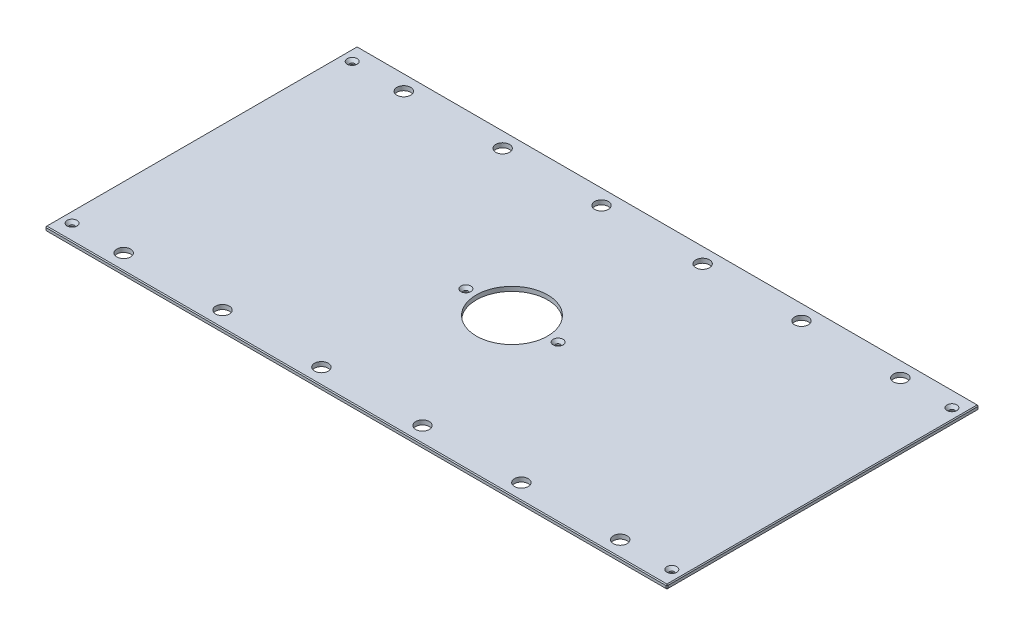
ISO-10303-21;
HEADER;
FILE_DESCRIPTION(('STEP AP214'),'2;1');
FILE_NAME('part.step','',(''),(''),'','','');
FILE_SCHEMA(('AUTOMOTIVE_DESIGN { 1 0 10303 214 1 1 1 1 }'));
ENDSEC;
DATA;
#1=APPLICATION_CONTEXT('core data for automotive mechanical design processes');
#2=APPLICATION_PROTOCOL_DEFINITION('international standard','automotive_design',2000,#1);
#3=PRODUCT_CONTEXT('',#1,'mechanical');
#4=PRODUCT('Part','Part','',(#3));
#5=PRODUCT_RELATED_PRODUCT_CATEGORY('part','',(#4));
#6=PRODUCT_DEFINITION_FORMATION('','',#4);
#7=PRODUCT_DEFINITION_CONTEXT('part definition',#1,'design');
#8=PRODUCT_DEFINITION('design','',#6,#7);
#9=PRODUCT_DEFINITION_SHAPE('','',#8);
#10=(LENGTH_UNIT() NAMED_UNIT(*) SI_UNIT(.MILLI.,.METRE.));
#11=(NAMED_UNIT(*) PLANE_ANGLE_UNIT() SI_UNIT($,.RADIAN.));
#12=(NAMED_UNIT(*) SI_UNIT($,.STERADIAN.) SOLID_ANGLE_UNIT());
#13=UNCERTAINTY_MEASURE_WITH_UNIT(LENGTH_MEASURE(1.E-05),#10,'distance_accuracy_value','');
#14=(GEOMETRIC_REPRESENTATION_CONTEXT(3) GLOBAL_UNCERTAINTY_ASSIGNED_CONTEXT((#13)) GLOBAL_UNIT_ASSIGNED_CONTEXT((#10,
#11,#12)) REPRESENTATION_CONTEXT('',''));
#15=CARTESIAN_POINT('',(0.,0.,0.));
#16=DIRECTION('',(0.,0.,1.));
#17=DIRECTION('',(1.,0.,0.));
#18=AXIS2_PLACEMENT_3D('',#15,#16,#17);
#19=CARTESIAN_POINT('',(-449.2625,6.35,-225.425));
#20=DIRECTION('',(1.,0.,0.));
#21=DIRECTION('',(0.,0.,-1.));
#22=AXIS2_PLACEMENT_3D('',#19,#20,#21);
#23=PLANE('',#22);
#24=DIRECTION('',(0.,0.,-1.));
#25=VECTOR('',#24,1.);
#26=CARTESIAN_POINT('',(-449.2625,5.08000000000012,-225.425));
#27=LINE('',#26,#25);
#28=CARTESIAN_POINT('',(-449.2625,5.08000000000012,224.155));
#29=VERTEX_POINT('',#28);
#30=CARTESIAN_POINT('',(-449.2625,5.08000000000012,-224.155));
#31=VERTEX_POINT('',#30);
#32=EDGE_CURVE('E140',#29,#31,#27,.T.);
#33=ORIENTED_EDGE('',*,*,#32,.T.);
#34=DIRECTION('',(0.,-1.,0.));
#35=VECTOR('',#34,1.);
#36=CARTESIAN_POINT('',(-449.2625,6.35,-224.155));
#37=LINE('',#36,#35);
#38=CARTESIAN_POINT('',(-449.2625,1.26999999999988,-224.155));
#39=VERTEX_POINT('',#38);
#40=EDGE_CURVE('E135',#31,#39,#37,.T.);
#41=ORIENTED_EDGE('',*,*,#40,.T.);
#42=DIRECTION('',(0.,0.,1.));
#43=VECTOR('',#42,1.);
#44=CARTESIAN_POINT('',(-449.2625,1.26999999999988,-225.425));
#45=LINE('',#44,#43);
#46=CARTESIAN_POINT('',(-449.2625,1.26999999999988,224.155));
#47=VERTEX_POINT('',#46);
#48=EDGE_CURVE('E130',#39,#47,#45,.T.);
#49=ORIENTED_EDGE('',*,*,#48,.T.);
#50=DIRECTION('',(0.,1.,0.));
#51=VECTOR('',#50,1.);
#52=CARTESIAN_POINT('',(-449.2625,6.35,224.155));
#53=LINE('',#52,#51);
#54=EDGE_CURVE('E132',#47,#29,#53,.T.);
#55=ORIENTED_EDGE('',*,*,#54,.T.);
#56=EDGE_LOOP('',(#33,#41,#49,#55));
#57=FACE_BOUND('',#56,.T.);
#58=ADVANCED_FACE('F38',(#57),#23,.F.);
#59=CARTESIAN_POINT('',(-449.2625,6.35,225.425));
#60=DIRECTION('',(0.,0.,-1.));
#61=DIRECTION('',(-1.,0.,0.));
#62=AXIS2_PLACEMENT_3D('',#59,#60,#61);
#63=PLANE('',#62);
#64=DIRECTION('',(1.,0.,0.));
#65=VECTOR('',#64,1.);
#66=CARTESIAN_POINT('',(-449.2625,1.26999999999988,225.425));
#67=LINE('',#66,#65);
#68=CARTESIAN_POINT('',(-447.9925,1.26999999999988,225.425));
#69=VERTEX_POINT('',#68);
#70=CARTESIAN_POINT('',(447.9925,1.26999999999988,225.425));
#71=VERTEX_POINT('',#70);
#72=EDGE_CURVE('E62',#69,#71,#67,.T.);
#73=ORIENTED_EDGE('',*,*,#72,.T.);
#74=DIRECTION('',(0.,1.,0.));
#75=VECTOR('',#74,1.);
#76=CARTESIAN_POINT('',(447.9925,6.35,225.425));
#77=LINE('',#76,#75);
#78=CARTESIAN_POINT('',(447.9925,5.08000000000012,225.425));
#79=VERTEX_POINT('',#78);
#80=EDGE_CURVE('E11',#71,#79,#77,.T.);
#81=ORIENTED_EDGE('',*,*,#80,.T.);
#82=DIRECTION('',(-1.,0.,0.));
#83=VECTOR('',#82,1.);
#84=CARTESIAN_POINT('',(-449.2625,5.08000000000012,225.425));
#85=LINE('',#84,#83);
#86=CARTESIAN_POINT('',(-447.9925,5.08000000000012,225.425));
#87=VERTEX_POINT('',#86);
#88=EDGE_CURVE('E48',#79,#87,#85,.T.);
#89=ORIENTED_EDGE('',*,*,#88,.T.);
#90=DIRECTION('',(0.,-1.,0.));
#91=VECTOR('',#90,1.);
#92=CARTESIAN_POINT('',(-447.9925,6.35,225.425));
#93=LINE('',#92,#91);
#94=EDGE_CURVE('E398',#87,#69,#93,.T.);
#95=ORIENTED_EDGE('',*,*,#94,.T.);
#96=EDGE_LOOP('',(#73,#81,#89,#95));
#97=FACE_BOUND('',#96,.T.);
#98=ADVANCED_FACE('F475',(#97),#63,.F.);
#99=CARTESIAN_POINT('',(449.2625,6.35,-225.425));
#100=DIRECTION('',(-1.,0.,0.));
#101=DIRECTION('',(0.,0.,1.));
#102=AXIS2_PLACEMENT_3D('',#99,#100,#101);
#103=PLANE('',#102);
#104=DIRECTION('',(0.,0.,-1.));
#105=VECTOR('',#104,1.);
#106=CARTESIAN_POINT('',(449.2625,1.26999999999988,-225.425));
#107=LINE('',#106,#105);
#108=CARTESIAN_POINT('',(449.2625,1.26999999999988,224.155));
#109=VERTEX_POINT('',#108);
#110=CARTESIAN_POINT('',(449.2625,1.26999999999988,-224.155));
#111=VERTEX_POINT('',#110);
#112=EDGE_CURVE('E391',#109,#111,#107,.T.);
#113=ORIENTED_EDGE('',*,*,#112,.T.);
#114=DIRECTION('',(0.,1.,0.));
#115=VECTOR('',#114,1.);
#116=CARTESIAN_POINT('',(449.2625,6.35,-224.155));
#117=LINE('',#116,#115);
#118=CARTESIAN_POINT('',(449.2625,5.08000000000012,-224.155));
#119=VERTEX_POINT('',#118);
#120=EDGE_CURVE('E394',#111,#119,#117,.T.);
#121=ORIENTED_EDGE('',*,*,#120,.T.);
#122=DIRECTION('',(0.,0.,1.));
#123=VECTOR('',#122,1.);
#124=CARTESIAN_POINT('',(449.2625,5.08000000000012,225.425));
#125=LINE('',#124,#123);
#126=CARTESIAN_POINT('',(449.2625,5.08000000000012,224.155));
#127=VERTEX_POINT('',#126);
#128=EDGE_CURVE('E388',#119,#127,#125,.T.);
#129=ORIENTED_EDGE('',*,*,#128,.T.);
#130=DIRECTION('',(0.,-1.,0.));
#131=VECTOR('',#130,1.);
#132=CARTESIAN_POINT('',(449.2625,6.35,224.155));
#133=LINE('',#132,#131);
#134=EDGE_CURVE('E385',#127,#109,#133,.T.);
#135=ORIENTED_EDGE('',*,*,#134,.T.);
#136=EDGE_LOOP('',(#113,#121,#129,#135));
#137=FACE_BOUND('',#136,.T.);
#138=ADVANCED_FACE('F462',(#137),#103,.F.);
#139=CARTESIAN_POINT('',(-449.2625,6.35,-225.425));
#140=DIRECTION('',(0.,0.,1.));
#141=DIRECTION('',(1.,0.,0.));
#142=AXIS2_PLACEMENT_3D('',#139,#140,#141);
#143=PLANE('',#142);
#144=DIRECTION('',(-1.,0.,0.));
#145=VECTOR('',#144,1.);
#146=CARTESIAN_POINT('',(-449.2625,1.26999999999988,-225.425));
#147=LINE('',#146,#145);
#148=CARTESIAN_POINT('',(447.9925,1.26999999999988,-225.425));
#149=VERTEX_POINT('',#148);
#150=CARTESIAN_POINT('',(-447.9925,1.26999999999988,-225.425));
#151=VERTEX_POINT('',#150);
#152=EDGE_CURVE('E350',#149,#151,#147,.T.);
#153=ORIENTED_EDGE('',*,*,#152,.T.);
#154=DIRECTION('',(0.,1.,0.));
#155=VECTOR('',#154,1.);
#156=CARTESIAN_POINT('',(-447.9925,6.35,-225.425));
#157=LINE('',#156,#155);
#158=CARTESIAN_POINT('',(-447.9925,5.08000000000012,-225.425));
#159=VERTEX_POINT('',#158);
#160=EDGE_CURVE('E356',#151,#159,#157,.T.);
#161=ORIENTED_EDGE('',*,*,#160,.T.);
#162=DIRECTION('',(1.,0.,0.));
#163=VECTOR('',#162,1.);
#164=CARTESIAN_POINT('',(449.2625,5.08000000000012,-225.425));
#165=LINE('',#164,#163);
#166=CARTESIAN_POINT('',(447.9925,5.08000000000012,-225.425));
#167=VERTEX_POINT('',#166);
#168=EDGE_CURVE('E353',#159,#167,#165,.T.);
#169=ORIENTED_EDGE('',*,*,#168,.T.);
#170=DIRECTION('',(0.,-1.,0.));
#171=VECTOR('',#170,1.);
#172=CARTESIAN_POINT('',(447.9925,6.35,-225.425));
#173=LINE('',#172,#171);
#174=EDGE_CURVE('E347',#167,#149,#173,.T.);
#175=ORIENTED_EDGE('',*,*,#174,.T.);
#176=EDGE_LOOP('',(#153,#161,#169,#175));
#177=FACE_BOUND('',#176,.T.);
#178=ADVANCED_FACE('F436',(#177),#143,.F.);
#179=CARTESIAN_POINT('',(0.,6.35,0.));
#180=DIRECTION('',(0.,1.,0.));
#181=DIRECTION('',(0.,0.,1.));
#182=AXIS2_PLACEMENT_3D('',#179,#180,#181);
#183=PLANE('',#182);
#184=CARTESIAN_POINT('',(433.3875,6.35,-202.40498));
#185=DIRECTION('',(0.,1.,0.));
#186=DIRECTION('',(0.,0.,1.));
#187=AXIS2_PLACEMENT_3D('',#184,#185,#186);
#188=CIRCLE('',#187,7.13740000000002);
#189=CARTESIAN_POINT('',(433.3875,6.35,-195.26758));
#190=VERTEX_POINT('',#189);
#191=EDGE_CURVE('E1071',#190,#190,#188,.T.);
#192=ORIENTED_EDGE('',*,*,#191,.F.);
#193=EDGE_LOOP('',(#192));
#194=FACE_BOUND('',#193,.T.);
#195=CARTESIAN_POINT('',(433.3875,6.35,202.40498));
#196=DIRECTION('',(0.,1.,0.));
#197=DIRECTION('',(0.,0.,1.));
#198=AXIS2_PLACEMENT_3D('',#195,#196,#197);
#199=CIRCLE('',#198,7.13740000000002);
#200=CARTESIAN_POINT('',(433.3875,6.35,209.54238));
#201=VERTEX_POINT('',#200);
#202=EDGE_CURVE('E1075',#201,#201,#199,.T.);
#203=ORIENTED_EDGE('',*,*,#202,.F.);
#204=EDGE_LOOP('',(#203));
#205=FACE_BOUND('',#204,.T.);
#206=CARTESIAN_POINT('',(-433.3875,6.35,202.40498));
#207=DIRECTION('',(0.,1.,0.));
#208=DIRECTION('',(0.,0.,1.));
#209=AXIS2_PLACEMENT_3D('',#206,#207,#208);
#210=CIRCLE('',#209,7.13740000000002);
#211=CARTESIAN_POINT('',(-433.3875,6.35,209.54238));
#212=VERTEX_POINT('',#211);
#213=EDGE_CURVE('E1079',#212,#212,#210,.T.);
#214=ORIENTED_EDGE('',*,*,#213,.F.);
#215=EDGE_LOOP('',(#214));
#216=FACE_BOUND('',#215,.T.);
#217=CARTESIAN_POINT('',(-66.675,6.35,0.));
#218=DIRECTION('',(0.,1.,0.));
#219=DIRECTION('',(0.,0.,1.));
#220=AXIS2_PLACEMENT_3D('',#217,#218,#219);
#221=CIRCLE('',#220,7.1374);
#222=CARTESIAN_POINT('',(-66.675,6.35,7.1374));
#223=VERTEX_POINT('',#222);
#224=EDGE_CURVE('E1083',#223,#223,#221,.T.);
#225=ORIENTED_EDGE('',*,*,#224,.F.);
#226=EDGE_LOOP('',(#225));
#227=FACE_BOUND('',#226,.T.);
#228=CARTESIAN_POINT('',(66.675,6.35,0.));
#229=DIRECTION('',(0.,1.,0.));
#230=DIRECTION('',(0.,0.,1.));
#231=AXIS2_PLACEMENT_3D('',#228,#229,#230);
#232=CIRCLE('',#231,7.1374);
#233=CARTESIAN_POINT('',(66.675,6.35,7.1374));
#234=VERTEX_POINT('',#233);
#235=EDGE_CURVE('E1087',#234,#234,#232,.T.);
#236=ORIENTED_EDGE('',*,*,#235,.F.);
#237=EDGE_LOOP('',(#236));
#238=FACE_BOUND('',#237,.T.);
#239=CARTESIAN_POINT('',(-433.3875,6.35,-202.40498));
#240=DIRECTION('',(0.,1.,0.));
#241=DIRECTION('',(0.,0.,1.));
#242=AXIS2_PLACEMENT_3D('',#239,#240,#241);
#243=CIRCLE('',#242,7.13740000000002);
#244=CARTESIAN_POINT('',(-433.3875,6.35,-195.26758));
#245=VERTEX_POINT('',#244);
#246=EDGE_CURVE('E1090',#245,#245,#243,.T.);
#247=ORIENTED_EDGE('',*,*,#246,.F.);
#248=EDGE_LOOP('',(#247));
#249=FACE_BOUND('',#248,.T.);
#250=DIRECTION('',(0.,0.,-1.));
#251=VECTOR('',#250,1.);
#252=CARTESIAN_POINT('',(447.9925,6.35,-225.425));
#253=LINE('',#252,#251);
#254=CARTESIAN_POINT('',(447.9925,6.35,224.155));
#255=VERTEX_POINT('',#254);
#256=CARTESIAN_POINT('',(447.9925,6.35,-224.155));
#257=VERTEX_POINT('',#256);
#258=EDGE_CURVE('E366',#255,#257,#253,.T.);
#259=ORIENTED_EDGE('',*,*,#258,.T.);
#260=DIRECTION('',(-1.,0.,0.));
#261=VECTOR('',#260,1.);
#262=CARTESIAN_POINT('',(-449.2625,6.35,-224.155));
#263=LINE('',#262,#261);
#264=CARTESIAN_POINT('',(-447.9925,6.35,-224.155));
#265=VERTEX_POINT('',#264);
#266=EDGE_CURVE('E369',#257,#265,#263,.T.);
#267=ORIENTED_EDGE('',*,*,#266,.T.);
#268=DIRECTION('',(0.,0.,1.));
#269=VECTOR('',#268,1.);
#270=CARTESIAN_POINT('',(-447.9925,6.35,225.425));
#271=LINE('',#270,#269);
#272=CARTESIAN_POINT('',(-447.9925,6.35,224.155));
#273=VERTEX_POINT('',#272);
#274=EDGE_CURVE('E363',#265,#273,#271,.T.);
#275=ORIENTED_EDGE('',*,*,#274,.T.);
#276=DIRECTION('',(1.,0.,0.));
#277=VECTOR('',#276,1.);
#278=CARTESIAN_POINT('',(449.2625,6.35,224.155));
#279=LINE('',#278,#277);
#280=EDGE_CURVE('E360',#273,#255,#279,.T.);
#281=ORIENTED_EDGE('',*,*,#280,.T.);
#282=EDGE_LOOP('',(#259,#267,#275,#281));
#283=FACE_BOUND('',#282,.T.);
#284=CARTESIAN_POINT('',(358.775,6.35,-202.40498));
#285=DIRECTION('',(0.,1.,0.));
#286=DIRECTION('',(0.,0.,1.));
#287=AXIS2_PLACEMENT_3D('',#284,#285,#286);
#288=CIRCLE('',#287,9.92187500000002);
#289=CARTESIAN_POINT('',(358.775,6.35,-192.483105));
#290=VERTEX_POINT('',#289);
#291=EDGE_CURVE('E231',#290,#290,#288,.T.);
#292=ORIENTED_EDGE('',*,*,#291,.F.);
#293=EDGE_LOOP('',(#292));
#294=FACE_BOUND('',#293,.T.);
#295=CARTESIAN_POINT('',(-358.775,6.35,-202.40498));
#296=DIRECTION('',(0.,1.,0.));
#297=DIRECTION('',(0.,0.,1.));
#298=AXIS2_PLACEMENT_3D('',#295,#296,#297);
#299=CIRCLE('',#298,9.92187500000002);
#300=CARTESIAN_POINT('',(-358.775,6.35,-192.483105));
#301=VERTEX_POINT('',#300);
#302=EDGE_CURVE('E246',#301,#301,#299,.T.);
#303=ORIENTED_EDGE('',*,*,#302,.F.);
#304=EDGE_LOOP('',(#303));
#305=FACE_BOUND('',#304,.T.);
#306=CARTESIAN_POINT('',(358.775,6.35,202.40498));
#307=DIRECTION('',(0.,1.,0.));
#308=DIRECTION('',(0.,0.,1.));
#309=AXIS2_PLACEMENT_3D('',#306,#307,#308);
#310=CIRCLE('',#309,9.92187500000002);
#311=CARTESIAN_POINT('',(358.775,6.35,212.326855));
#312=VERTEX_POINT('',#311);
#313=EDGE_CURVE('E259',#312,#312,#310,.T.);
#314=ORIENTED_EDGE('',*,*,#313,.F.);
#315=EDGE_LOOP('',(#314));
#316=FACE_BOUND('',#315,.T.);
#317=CARTESIAN_POINT('',(-358.775,6.35,202.40498));
#318=DIRECTION('',(0.,1.,0.));
#319=DIRECTION('',(0.,0.,1.));
#320=AXIS2_PLACEMENT_3D('',#317,#318,#319);
#321=CIRCLE('',#320,9.92187500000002);
#322=CARTESIAN_POINT('',(-358.775,6.35,212.326855));
#323=VERTEX_POINT('',#322);
#324=EDGE_CURVE('E267',#323,#323,#321,.T.);
#325=ORIENTED_EDGE('',*,*,#324,.F.);
#326=EDGE_LOOP('',(#325));
#327=FACE_BOUND('',#326,.T.);
#328=CARTESIAN_POINT('',(-215.9,6.35,-202.40498));
#329=DIRECTION('',(0.,1.,0.));
#330=DIRECTION('',(0.,0.,1.));
#331=AXIS2_PLACEMENT_3D('',#328,#329,#330);
#332=CIRCLE('',#331,9.921875);
#333=CARTESIAN_POINT('',(-215.9,6.35,-192.483105));
#334=VERTEX_POINT('',#333);
#335=EDGE_CURVE('E275',#334,#334,#332,.T.);
#336=ORIENTED_EDGE('',*,*,#335,.F.);
#337=EDGE_LOOP('',(#336));
#338=FACE_BOUND('',#337,.T.);
#339=CARTESIAN_POINT('',(215.9,6.35,-202.40498));
#340=DIRECTION('',(0.,1.,0.));
#341=DIRECTION('',(0.,0.,1.));
#342=AXIS2_PLACEMENT_3D('',#339,#340,#341);
#343=CIRCLE('',#342,9.921875);
#344=CARTESIAN_POINT('',(215.9,6.35,-192.483105));
#345=VERTEX_POINT('',#344);
#346=EDGE_CURVE('E283',#345,#345,#343,.T.);
#347=ORIENTED_EDGE('',*,*,#346,.F.);
#348=EDGE_LOOP('',(#347));
#349=FACE_BOUND('',#348,.T.);
#350=CARTESIAN_POINT('',(215.9,6.35,202.40498));
#351=DIRECTION('',(0.,1.,0.));
#352=DIRECTION('',(0.,0.,1.));
#353=AXIS2_PLACEMENT_3D('',#350,#351,#352);
#354=CIRCLE('',#353,9.921875);
#355=CARTESIAN_POINT('',(215.9,6.35,212.326855));
#356=VERTEX_POINT('',#355);
#357=EDGE_CURVE('E290',#356,#356,#354,.T.);
#358=ORIENTED_EDGE('',*,*,#357,.F.);
#359=EDGE_LOOP('',(#358));
#360=FACE_BOUND('',#359,.T.);
#361=CARTESIAN_POINT('',(-215.9,6.35,202.40498));
#362=DIRECTION('',(0.,1.,0.));
#363=DIRECTION('',(0.,0.,1.));
#364=AXIS2_PLACEMENT_3D('',#361,#362,#363);
#365=CIRCLE('',#364,9.921875);
#366=CARTESIAN_POINT('',(-215.9,6.35,212.326855));
#367=VERTEX_POINT('',#366);
#368=EDGE_CURVE('E297',#367,#367,#365,.T.);
#369=ORIENTED_EDGE('',*,*,#368,.F.);
#370=EDGE_LOOP('',(#369));
#371=FACE_BOUND('',#370,.T.);
#372=CARTESIAN_POINT('',(73.025,6.35,-202.40498));
#373=DIRECTION('',(0.,1.,0.));
#374=DIRECTION('',(0.,0.,1.));
#375=AXIS2_PLACEMENT_3D('',#372,#373,#374);
#376=CIRCLE('',#375,9.921875);
#377=CARTESIAN_POINT('',(73.025,6.35,-192.483105));
#378=VERTEX_POINT('',#377);
#379=EDGE_CURVE('E305',#378,#378,#376,.T.);
#380=ORIENTED_EDGE('',*,*,#379,.F.);
#381=EDGE_LOOP('',(#380));
#382=FACE_BOUND('',#381,.T.);
#383=CARTESIAN_POINT('',(-73.025,6.35,-202.40498));
#384=DIRECTION('',(0.,1.,0.));
#385=DIRECTION('',(0.,0.,1.));
#386=AXIS2_PLACEMENT_3D('',#383,#384,#385);
#387=CIRCLE('',#386,9.921875);
#388=CARTESIAN_POINT('',(-73.025,6.35,-192.483105));
#389=VERTEX_POINT('',#388);
#390=EDGE_CURVE('E313',#389,#389,#387,.T.);
#391=ORIENTED_EDGE('',*,*,#390,.F.);
#392=EDGE_LOOP('',(#391));
#393=FACE_BOUND('',#392,.T.);
#394=CARTESIAN_POINT('',(-73.025,6.35,202.40498));
#395=DIRECTION('',(0.,1.,0.));
#396=DIRECTION('',(0.,0.,1.));
#397=AXIS2_PLACEMENT_3D('',#394,#395,#396);
#398=CIRCLE('',#397,9.921875);
#399=CARTESIAN_POINT('',(-73.025,6.35,212.326855));
#400=VERTEX_POINT('',#399);
#401=EDGE_CURVE('E321',#400,#400,#398,.T.);
#402=ORIENTED_EDGE('',*,*,#401,.F.);
#403=EDGE_LOOP('',(#402));
#404=FACE_BOUND('',#403,.T.);
#405=CARTESIAN_POINT('',(73.025,6.35,202.40498));
#406=DIRECTION('',(0.,1.,0.));
#407=DIRECTION('',(0.,0.,1.));
#408=AXIS2_PLACEMENT_3D('',#405,#406,#407);
#409=CIRCLE('',#408,9.921875);
#410=CARTESIAN_POINT('',(73.025,6.35,212.326855));
#411=VERTEX_POINT('',#410);
#412=EDGE_CURVE('E328',#411,#411,#409,.T.);
#413=ORIENTED_EDGE('',*,*,#412,.F.);
#414=EDGE_LOOP('',(#413));
#415=FACE_BOUND('',#414,.T.);
#416=CARTESIAN_POINT('',(0.,6.35,0.));
#417=DIRECTION('',(0.,1.,0.));
#418=DIRECTION('',(0.,0.,1.));
#419=AXIS2_PLACEMENT_3D('',#416,#417,#418);
#420=CIRCLE('',#419,51.562);
#421=CARTESIAN_POINT('',(0.,6.35,51.562));
#422=VERTEX_POINT('',#421);
#423=EDGE_CURVE('E336',#422,#422,#420,.T.);
#424=ORIENTED_EDGE('',*,*,#423,.F.);
#425=EDGE_LOOP('',(#424));
#426=FACE_BOUND('',#425,.T.);
#427=ADVANCED_FACE('F484',(#194,#205,#216,#227,#238,#249,#283,#294,#305,#316,#327,#338,#349,
#360,#371,#382,#393,#404,#415,#426),#183,.T.);
#428=CARTESIAN_POINT('',(0.,0.,0.));
#429=DIRECTION('',(0.,1.,0.));
#430=DIRECTION('',(0.,0.,1.));
#431=AXIS2_PLACEMENT_3D('',#428,#429,#430);
#432=PLANE('',#431);
#433=CARTESIAN_POINT('',(433.3875,0.,-202.40498));
#434=DIRECTION('',(0.,1.,0.));
#435=DIRECTION('',(0.,0.,1.));
#436=AXIS2_PLACEMENT_3D('',#433,#434,#435);
#437=CIRCLE('',#436,3.3782);
#438=CARTESIAN_POINT('',(433.3875,0.,-199.02678));
#439=VERTEX_POINT('',#438);
#440=EDGE_CURVE('E1136',#439,#439,#437,.T.);
#441=ORIENTED_EDGE('',*,*,#440,.T.);
#442=EDGE_LOOP('',(#441));
#443=FACE_BOUND('',#442,.T.);
#444=CARTESIAN_POINT('',(433.3875,0.,202.40498));
#445=DIRECTION('',(0.,1.,0.));
#446=DIRECTION('',(0.,0.,1.));
#447=AXIS2_PLACEMENT_3D('',#444,#445,#446);
#448=CIRCLE('',#447,3.3782);
#449=CARTESIAN_POINT('',(433.3875,0.,205.78318));
#450=VERTEX_POINT('',#449);
#451=EDGE_CURVE('E1127',#450,#450,#448,.T.);
#452=ORIENTED_EDGE('',*,*,#451,.T.);
#453=EDGE_LOOP('',(#452));
#454=FACE_BOUND('',#453,.T.);
#455=CARTESIAN_POINT('',(-433.3875,0.,202.40498));
#456=DIRECTION('',(0.,1.,0.));
#457=DIRECTION('',(0.,0.,1.));
#458=AXIS2_PLACEMENT_3D('',#455,#456,#457);
#459=CIRCLE('',#458,3.3782);
#460=CARTESIAN_POINT('',(-433.3875,0.,205.78318));
#461=VERTEX_POINT('',#460);
#462=EDGE_CURVE('E1117',#461,#461,#459,.T.);
#463=ORIENTED_EDGE('',*,*,#462,.T.);
#464=EDGE_LOOP('',(#463));
#465=FACE_BOUND('',#464,.T.);
#466=CARTESIAN_POINT('',(-66.675,0.,0.));
#467=DIRECTION('',(0.,1.,0.));
#468=DIRECTION('',(0.,0.,1.));
#469=AXIS2_PLACEMENT_3D('',#466,#467,#468);
#470=CIRCLE('',#469,3.3782);
#471=CARTESIAN_POINT('',(-66.675,0.,3.3782));
#472=VERTEX_POINT('',#471);
#473=EDGE_CURVE('E1107',#472,#472,#470,.T.);
#474=ORIENTED_EDGE('',*,*,#473,.T.);
#475=EDGE_LOOP('',(#474));
#476=FACE_BOUND('',#475,.T.);
#477=CARTESIAN_POINT('',(66.675,0.,0.));
#478=DIRECTION('',(0.,1.,0.));
#479=DIRECTION('',(0.,0.,1.));
#480=AXIS2_PLACEMENT_3D('',#477,#478,#479);
#481=CIRCLE('',#480,3.3782);
#482=CARTESIAN_POINT('',(66.675,0.,3.3782));
#483=VERTEX_POINT('',#482);
#484=EDGE_CURVE('E1093',#483,#483,#481,.T.);
#485=ORIENTED_EDGE('',*,*,#484,.T.);
#486=EDGE_LOOP('',(#485));
#487=FACE_BOUND('',#486,.T.);
#488=CARTESIAN_POINT('',(-433.3875,0.,-202.40498));
#489=DIRECTION('',(0.,1.,0.));
#490=DIRECTION('',(0.,0.,1.));
#491=AXIS2_PLACEMENT_3D('',#488,#489,#490);
#492=CIRCLE('',#491,3.3782);
#493=CARTESIAN_POINT('',(-433.3875,0.,-199.02678));
#494=VERTEX_POINT('',#493);
#495=EDGE_CURVE('E249',#494,#494,#492,.T.);
#496=ORIENTED_EDGE('',*,*,#495,.T.);
#497=EDGE_LOOP('',(#496));
#498=FACE_BOUND('',#497,.T.);
#499=DIRECTION('',(0.,0.,-1.));
#500=VECTOR('',#499,1.);
#501=CARTESIAN_POINT('',(-447.9925,0.,0.));
#502=LINE('',#501,#500);
#503=CARTESIAN_POINT('',(-447.9925,0.,224.155));
#504=VERTEX_POINT('',#503);
#505=CARTESIAN_POINT('',(-447.9925,0.,-224.155));
#506=VERTEX_POINT('',#505);
#507=EDGE_CURVE('E165',#504,#506,#502,.T.);
#508=ORIENTED_EDGE('',*,*,#507,.T.);
#509=DIRECTION('',(1.,0.,0.));
#510=VECTOR('',#509,1.);
#511=CARTESIAN_POINT('',(0.,0.,-224.155));
#512=LINE('',#511,#510);
#513=CARTESIAN_POINT('',(447.9925,0.,-224.155));
#514=VERTEX_POINT('',#513);
#515=EDGE_CURVE('E381',#506,#514,#512,.T.);
#516=ORIENTED_EDGE('',*,*,#515,.T.);
#517=DIRECTION('',(0.,0.,1.));
#518=VECTOR('',#517,1.);
#519=CARTESIAN_POINT('',(447.9925,0.,0.));
#520=LINE('',#519,#518);
#521=CARTESIAN_POINT('',(447.9925,0.,224.155));
#522=VERTEX_POINT('',#521);
#523=EDGE_CURVE('E378',#514,#522,#520,.T.);
#524=ORIENTED_EDGE('',*,*,#523,.T.);
#525=DIRECTION('',(-1.,0.,0.));
#526=VECTOR('',#525,1.);
#527=CARTESIAN_POINT('',(0.,0.,224.155));
#528=LINE('',#527,#526);
#529=EDGE_CURVE('E373',#522,#504,#528,.T.);
#530=ORIENTED_EDGE('',*,*,#529,.T.);
#531=EDGE_LOOP('',(#508,#516,#524,#530));
#532=FACE_BOUND('',#531,.T.);
#533=CARTESIAN_POINT('',(358.775,0.,-202.40498));
#534=DIRECTION('',(0.,1.,0.));
#535=DIRECTION('',(0.,0.,1.));
#536=AXIS2_PLACEMENT_3D('',#533,#534,#535);
#537=CIRCLE('',#536,9.92187499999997);
#538=CARTESIAN_POINT('',(358.775,0.,-192.483105));
#539=VERTEX_POINT('',#538);
#540=EDGE_CURVE('E238',#539,#539,#537,.T.);
#541=ORIENTED_EDGE('',*,*,#540,.T.);
#542=EDGE_LOOP('',(#541));
#543=FACE_BOUND('',#542,.T.);
#544=CARTESIAN_POINT('',(-358.775,0.,-202.40498));
#545=DIRECTION('',(0.,1.,0.));
#546=DIRECTION('',(0.,0.,1.));
#547=AXIS2_PLACEMENT_3D('',#544,#545,#546);
#548=CIRCLE('',#547,9.92187499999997);
#549=CARTESIAN_POINT('',(-358.775,0.,-192.483105));
#550=VERTEX_POINT('',#549);
#551=EDGE_CURVE('E255',#550,#550,#548,.T.);
#552=ORIENTED_EDGE('',*,*,#551,.T.);
#553=EDGE_LOOP('',(#552));
#554=FACE_BOUND('',#553,.T.);
#555=CARTESIAN_POINT('',(358.775,0.,202.40498));
#556=DIRECTION('',(0.,1.,0.));
#557=DIRECTION('',(0.,0.,1.));
#558=AXIS2_PLACEMENT_3D('',#555,#556,#557);
#559=CIRCLE('',#558,9.92187499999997);
#560=CARTESIAN_POINT('',(358.775,0.,212.326855));
#561=VERTEX_POINT('',#560);
#562=EDGE_CURVE('E263',#561,#561,#559,.T.);
#563=ORIENTED_EDGE('',*,*,#562,.T.);
#564=EDGE_LOOP('',(#563));
#565=FACE_BOUND('',#564,.T.);
#566=CARTESIAN_POINT('',(-358.775,0.,202.40498));
#567=DIRECTION('',(0.,1.,0.));
#568=DIRECTION('',(0.,0.,1.));
#569=AXIS2_PLACEMENT_3D('',#566,#567,#568);
#570=CIRCLE('',#569,9.92187499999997);
#571=CARTESIAN_POINT('',(-358.775,0.,212.326855));
#572=VERTEX_POINT('',#571);
#573=EDGE_CURVE('E271',#572,#572,#570,.T.);
#574=ORIENTED_EDGE('',*,*,#573,.T.);
#575=EDGE_LOOP('',(#574));
#576=FACE_BOUND('',#575,.T.);
#577=CARTESIAN_POINT('',(-215.9,0.,-202.40498));
#578=DIRECTION('',(0.,1.,0.));
#579=DIRECTION('',(0.,0.,1.));
#580=AXIS2_PLACEMENT_3D('',#577,#578,#579);
#581=CIRCLE('',#580,9.921875);
#582=CARTESIAN_POINT('',(-215.9,0.,-192.483105));
#583=VERTEX_POINT('',#582);
#584=EDGE_CURVE('E279',#583,#583,#581,.T.);
#585=ORIENTED_EDGE('',*,*,#584,.T.);
#586=EDGE_LOOP('',(#585));
#587=FACE_BOUND('',#586,.T.);
#588=CARTESIAN_POINT('',(215.9,0.,-202.40498));
#589=DIRECTION('',(0.,1.,0.));
#590=DIRECTION('',(0.,0.,1.));
#591=AXIS2_PLACEMENT_3D('',#588,#589,#590);
#592=CIRCLE('',#591,9.921875);
#593=CARTESIAN_POINT('',(215.9,0.,-192.483105));
#594=VERTEX_POINT('',#593);
#595=EDGE_CURVE('E287',#594,#594,#592,.T.);
#596=ORIENTED_EDGE('',*,*,#595,.T.);
#597=EDGE_LOOP('',(#596));
#598=FACE_BOUND('',#597,.T.);
#599=CARTESIAN_POINT('',(215.9,0.,202.40498));
#600=DIRECTION('',(0.,1.,0.));
#601=DIRECTION('',(0.,0.,1.));
#602=AXIS2_PLACEMENT_3D('',#599,#600,#601);
#603=CIRCLE('',#602,9.921875);
#604=CARTESIAN_POINT('',(215.9,0.,212.326855));
#605=VERTEX_POINT('',#604);
#606=EDGE_CURVE('E293',#605,#605,#603,.T.);
#607=ORIENTED_EDGE('',*,*,#606,.T.);
#608=EDGE_LOOP('',(#607));
#609=FACE_BOUND('',#608,.T.);
#610=CARTESIAN_POINT('',(-215.9,0.,202.40498));
#611=DIRECTION('',(0.,1.,0.));
#612=DIRECTION('',(0.,0.,1.));
#613=AXIS2_PLACEMENT_3D('',#610,#611,#612);
#614=CIRCLE('',#613,9.921875);
#615=CARTESIAN_POINT('',(-215.9,0.,212.326855));
#616=VERTEX_POINT('',#615);
#617=EDGE_CURVE('E301',#616,#616,#614,.T.);
#618=ORIENTED_EDGE('',*,*,#617,.T.);
#619=EDGE_LOOP('',(#618));
#620=FACE_BOUND('',#619,.T.);
#621=CARTESIAN_POINT('',(73.025,0.,-202.40498));
#622=DIRECTION('',(0.,1.,0.));
#623=DIRECTION('',(0.,0.,1.));
#624=AXIS2_PLACEMENT_3D('',#621,#622,#623);
#625=CIRCLE('',#624,9.921875);
#626=CARTESIAN_POINT('',(73.025,0.,-192.483105));
#627=VERTEX_POINT('',#626);
#628=EDGE_CURVE('E309',#627,#627,#625,.T.);
#629=ORIENTED_EDGE('',*,*,#628,.T.);
#630=EDGE_LOOP('',(#629));
#631=FACE_BOUND('',#630,.T.);
#632=CARTESIAN_POINT('',(-73.025,0.,-202.40498));
#633=DIRECTION('',(0.,1.,0.));
#634=DIRECTION('',(0.,0.,1.));
#635=AXIS2_PLACEMENT_3D('',#632,#633,#634);
#636=CIRCLE('',#635,9.921875);
#637=CARTESIAN_POINT('',(-73.025,0.,-192.483105));
#638=VERTEX_POINT('',#637);
#639=EDGE_CURVE('E317',#638,#638,#636,.T.);
#640=ORIENTED_EDGE('',*,*,#639,.T.);
#641=EDGE_LOOP('',(#640));
#642=FACE_BOUND('',#641,.T.);
#643=CARTESIAN_POINT('',(-73.025,0.,202.40498));
#644=DIRECTION('',(0.,1.,0.));
#645=DIRECTION('',(0.,0.,1.));
#646=AXIS2_PLACEMENT_3D('',#643,#644,#645);
#647=CIRCLE('',#646,9.921875);
#648=CARTESIAN_POINT('',(-73.025,0.,212.326855));
#649=VERTEX_POINT('',#648);
#650=EDGE_CURVE('E324',#649,#649,#647,.T.);
#651=ORIENTED_EDGE('',*,*,#650,.T.);
#652=EDGE_LOOP('',(#651));
#653=FACE_BOUND('',#652,.T.);
#654=CARTESIAN_POINT('',(73.025,0.,202.40498));
#655=DIRECTION('',(0.,1.,0.));
#656=DIRECTION('',(0.,0.,1.));
#657=AXIS2_PLACEMENT_3D('',#654,#655,#656);
#658=CIRCLE('',#657,9.921875);
#659=CARTESIAN_POINT('',(73.025,0.,212.326855));
#660=VERTEX_POINT('',#659);
#661=EDGE_CURVE('E332',#660,#660,#658,.T.);
#662=ORIENTED_EDGE('',*,*,#661,.T.);
#663=EDGE_LOOP('',(#662));
#664=FACE_BOUND('',#663,.T.);
#665=CARTESIAN_POINT('',(0.,0.,0.));
#666=DIRECTION('',(0.,1.,0.));
#667=DIRECTION('',(0.,0.,1.));
#668=AXIS2_PLACEMENT_3D('',#665,#666,#667);
#669=CIRCLE('',#668,51.562);
#670=CARTESIAN_POINT('',(0.,0.,51.562));
#671=VERTEX_POINT('',#670);
#672=EDGE_CURVE('E153',#671,#671,#669,.T.);
#673=ORIENTED_EDGE('',*,*,#672,.T.);
#674=EDGE_LOOP('',(#673));
#675=FACE_BOUND('',#674,.T.);
#676=ADVANCED_FACE('F449',(#443,#454,#465,#476,#487,#498,#532,#543,#554,#565,#576,#587,#598,
#609,#620,#631,#642,#653,#664,#675),#432,.F.);
#677=CARTESIAN_POINT('',(0.,0.,0.));
#678=DIRECTION('',(0.,1.,0.));
#679=DIRECTION('',(0.,0.,1.));
#680=AXIS2_PLACEMENT_3D('',#677,#678,#679);
#681=CYLINDRICAL_SURFACE('',#680,51.562);
#682=ORIENTED_EDGE('',*,*,#672,.F.);
#683=EDGE_LOOP('',(#682));
#684=FACE_BOUND('',#683,.T.);
#685=ORIENTED_EDGE('',*,*,#423,.T.);
#686=EDGE_LOOP('',(#685));
#687=FACE_BOUND('',#686,.T.);
#688=ADVANCED_FACE('F730',(#684,#687),#681,.F.);
#689=CARTESIAN_POINT('',(73.025,6.35,202.40498));
#690=DIRECTION('',(0.,1.,0.));
#691=DIRECTION('',(0.,0.,1.));
#692=AXIS2_PLACEMENT_3D('',#689,#690,#691);
#693=CYLINDRICAL_SURFACE('',#692,9.921875);
#694=ORIENTED_EDGE('',*,*,#661,.F.);
#695=EDGE_LOOP('',(#694));
#696=FACE_BOUND('',#695,.T.);
#697=ORIENTED_EDGE('',*,*,#412,.T.);
#698=EDGE_LOOP('',(#697));
#699=FACE_BOUND('',#698,.T.);
#700=ADVANCED_FACE('F964',(#696,#699),#693,.F.);
#701=CARTESIAN_POINT('',(-73.025,6.35,202.40498));
#702=DIRECTION('',(0.,1.,0.));
#703=DIRECTION('',(0.,0.,1.));
#704=AXIS2_PLACEMENT_3D('',#701,#702,#703);
#705=CYLINDRICAL_SURFACE('',#704,9.921875);
#706=ORIENTED_EDGE('',*,*,#650,.F.);
#707=EDGE_LOOP('',(#706));
#708=FACE_BOUND('',#707,.T.);
#709=ORIENTED_EDGE('',*,*,#401,.T.);
#710=EDGE_LOOP('',(#709));
#711=FACE_BOUND('',#710,.T.);
#712=ADVANCED_FACE('F954',(#708,#711),#705,.F.);
#713=CARTESIAN_POINT('',(-73.025,6.35,-202.40498));
#714=DIRECTION('',(0.,1.,0.));
#715=DIRECTION('',(0.,0.,1.));
#716=AXIS2_PLACEMENT_3D('',#713,#714,#715);
#717=CYLINDRICAL_SURFACE('',#716,9.921875);
#718=ORIENTED_EDGE('',*,*,#639,.F.);
#719=EDGE_LOOP('',(#718));
#720=FACE_BOUND('',#719,.T.);
#721=ORIENTED_EDGE('',*,*,#390,.T.);
#722=EDGE_LOOP('',(#721));
#723=FACE_BOUND('',#722,.T.);
#724=ADVANCED_FACE('F944',(#720,#723),#717,.F.);
#725=CARTESIAN_POINT('',(73.025,6.35,-202.40498));
#726=DIRECTION('',(0.,1.,0.));
#727=DIRECTION('',(0.,0.,1.));
#728=AXIS2_PLACEMENT_3D('',#725,#726,#727);
#729=CYLINDRICAL_SURFACE('',#728,9.921875);
#730=ORIENTED_EDGE('',*,*,#628,.F.);
#731=EDGE_LOOP('',(#730));
#732=FACE_BOUND('',#731,.T.);
#733=ORIENTED_EDGE('',*,*,#379,.T.);
#734=EDGE_LOOP('',(#733));
#735=FACE_BOUND('',#734,.T.);
#736=ADVANCED_FACE('F934',(#732,#735),#729,.F.);
#737=CARTESIAN_POINT('',(-215.9,6.35,202.40498));
#738=DIRECTION('',(0.,1.,0.));
#739=DIRECTION('',(0.,0.,1.));
#740=AXIS2_PLACEMENT_3D('',#737,#738,#739);
#741=CYLINDRICAL_SURFACE('',#740,9.921875);
#742=ORIENTED_EDGE('',*,*,#617,.F.);
#743=EDGE_LOOP('',(#742));
#744=FACE_BOUND('',#743,.T.);
#745=ORIENTED_EDGE('',*,*,#368,.T.);
#746=EDGE_LOOP('',(#745));
#747=FACE_BOUND('',#746,.T.);
#748=ADVANCED_FACE('F924',(#744,#747),#741,.F.);
#749=CARTESIAN_POINT('',(215.9,6.35,202.40498));
#750=DIRECTION('',(0.,1.,0.));
#751=DIRECTION('',(0.,0.,1.));
#752=AXIS2_PLACEMENT_3D('',#749,#750,#751);
#753=CYLINDRICAL_SURFACE('',#752,9.921875);
#754=ORIENTED_EDGE('',*,*,#606,.F.);
#755=EDGE_LOOP('',(#754));
#756=FACE_BOUND('',#755,.T.);
#757=ORIENTED_EDGE('',*,*,#357,.T.);
#758=EDGE_LOOP('',(#757));
#759=FACE_BOUND('',#758,.T.);
#760=ADVANCED_FACE('F914',(#756,#759),#753,.F.);
#761=CARTESIAN_POINT('',(215.9,6.35,-202.40498));
#762=DIRECTION('',(0.,1.,0.));
#763=DIRECTION('',(0.,0.,1.));
#764=AXIS2_PLACEMENT_3D('',#761,#762,#763);
#765=CYLINDRICAL_SURFACE('',#764,9.921875);
#766=ORIENTED_EDGE('',*,*,#595,.F.);
#767=EDGE_LOOP('',(#766));
#768=FACE_BOUND('',#767,.T.);
#769=ORIENTED_EDGE('',*,*,#346,.T.);
#770=EDGE_LOOP('',(#769));
#771=FACE_BOUND('',#770,.T.);
#772=ADVANCED_FACE('F904',(#768,#771),#765,.F.);
#773=CARTESIAN_POINT('',(-215.9,6.35,-202.40498));
#774=DIRECTION('',(0.,1.,0.));
#775=DIRECTION('',(0.,0.,1.));
#776=AXIS2_PLACEMENT_3D('',#773,#774,#775);
#777=CYLINDRICAL_SURFACE('',#776,9.921875);
#778=ORIENTED_EDGE('',*,*,#584,.F.);
#779=EDGE_LOOP('',(#778));
#780=FACE_BOUND('',#779,.T.);
#781=ORIENTED_EDGE('',*,*,#335,.T.);
#782=EDGE_LOOP('',(#781));
#783=FACE_BOUND('',#782,.T.);
#784=ADVANCED_FACE('F894',(#780,#783),#777,.F.);
#785=CARTESIAN_POINT('',(-358.775,6.35,202.40498));
#786=DIRECTION('',(0.,1.,0.));
#787=DIRECTION('',(0.,0.,1.));
#788=AXIS2_PLACEMENT_3D('',#785,#786,#787);
#789=CYLINDRICAL_SURFACE('',#788,9.921875);
#790=ORIENTED_EDGE('',*,*,#573,.F.);
#791=EDGE_LOOP('',(#790));
#792=FACE_BOUND('',#791,.T.);
#793=ORIENTED_EDGE('',*,*,#324,.T.);
#794=EDGE_LOOP('',(#793));
#795=FACE_BOUND('',#794,.T.);
#796=ADVANCED_FACE('F884',(#792,#795),#789,.F.);
#797=CARTESIAN_POINT('',(358.775,6.35,202.40498));
#798=DIRECTION('',(0.,1.,0.));
#799=DIRECTION('',(0.,0.,1.));
#800=AXIS2_PLACEMENT_3D('',#797,#798,#799);
#801=CYLINDRICAL_SURFACE('',#800,9.921875);
#802=ORIENTED_EDGE('',*,*,#562,.F.);
#803=EDGE_LOOP('',(#802));
#804=FACE_BOUND('',#803,.T.);
#805=ORIENTED_EDGE('',*,*,#313,.T.);
#806=EDGE_LOOP('',(#805));
#807=FACE_BOUND('',#806,.T.);
#808=ADVANCED_FACE('F874',(#804,#807),#801,.F.);
#809=CARTESIAN_POINT('',(-358.775,6.35,-202.40498));
#810=DIRECTION('',(0.,1.,0.));
#811=DIRECTION('',(0.,0.,1.));
#812=AXIS2_PLACEMENT_3D('',#809,#810,#811);
#813=CYLINDRICAL_SURFACE('',#812,9.921875);
#814=ORIENTED_EDGE('',*,*,#551,.F.);
#815=EDGE_LOOP('',(#814));
#816=FACE_BOUND('',#815,.T.);
#817=ORIENTED_EDGE('',*,*,#302,.T.);
#818=EDGE_LOOP('',(#817));
#819=FACE_BOUND('',#818,.T.);
#820=ADVANCED_FACE('F864',(#816,#819),#813,.F.);
#821=CARTESIAN_POINT('',(358.775,6.35,-202.40498));
#822=DIRECTION('',(0.,1.,0.));
#823=DIRECTION('',(0.,0.,1.));
#824=AXIS2_PLACEMENT_3D('',#821,#822,#823);
#825=CYLINDRICAL_SURFACE('',#824,9.921875);
#826=ORIENTED_EDGE('',*,*,#540,.F.);
#827=EDGE_LOOP('',(#826));
#828=FACE_BOUND('',#827,.T.);
#829=ORIENTED_EDGE('',*,*,#291,.T.);
#830=EDGE_LOOP('',(#829));
#831=FACE_BOUND('',#830,.T.);
#832=ADVANCED_FACE('F493',(#828,#831),#825,.F.);
#833=CARTESIAN_POINT('',(449.2625,6.35,224.155));
#834=DIRECTION('',(-0.707106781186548,0.,-0.707106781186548));
#835=DIRECTION('',(0.,-1.,0.));
#836=AXIS2_PLACEMENT_3D('',#833,#834,#835);
#837=PLANE('',#836);
#838=DIRECTION('',(-0.707106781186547,0.,0.707106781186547));
#839=VECTOR('',#838,1.);
#840=CARTESIAN_POINT('',(449.2625,5.08000000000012,224.155));
#841=LINE('',#840,#839);
#842=EDGE_CURVE('E42',#79,#127,#841,.F.);
#843=ORIENTED_EDGE('',*,*,#842,.F.);
#844=ORIENTED_EDGE('',*,*,#80,.F.);
#845=DIRECTION('',(0.707106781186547,0.,-0.707106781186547));
#846=VECTOR('',#845,1.);
#847=CARTESIAN_POINT('',(448.6275,1.26999999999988,224.79));
#848=LINE('',#847,#846);
#849=EDGE_CURVE('E220',#109,#71,#848,.F.);
#850=ORIENTED_EDGE('',*,*,#849,.F.);
#851=ORIENTED_EDGE('',*,*,#134,.F.);
#852=EDGE_LOOP('',(#843,#844,#850,#851));
#853=FACE_BOUND('',#852,.T.);
#854=ADVANCED_FACE('F40',(#853),#837,.F.);
#855=CARTESIAN_POINT('',(449.2625,5.08000000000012,224.155));
#856=DIRECTION('',(0.577350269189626,0.577350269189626,0.577350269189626));
#857=DIRECTION('',(0.707106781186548,0.,-0.707106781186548));
#858=AXIS2_PLACEMENT_3D('',#855,#856,#857);
#859=PLANE('',#858);
#860=DIRECTION('',(0.,-0.707106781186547,0.707106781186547));
#861=VECTOR('',#860,1.);
#862=CARTESIAN_POINT('',(447.9925,5.71500000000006,224.79));
#863=LINE('',#862,#861);
#864=EDGE_CURVE('E214',#79,#255,#863,.F.);
#865=ORIENTED_EDGE('',*,*,#864,.F.);
#866=ORIENTED_EDGE('',*,*,#842,.T.);
#867=DIRECTION('',(-0.707106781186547,0.707106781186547,0.));
#868=VECTOR('',#867,1.);
#869=CARTESIAN_POINT('',(449.2625,5.08000000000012,224.155));
#870=LINE('',#869,#868);
#871=EDGE_CURVE('E217',#255,#127,#870,.F.);
#872=ORIENTED_EDGE('',*,*,#871,.F.);
#873=EDGE_LOOP('',(#865,#866,#872));
#874=FACE_BOUND('',#873,.T.);
#875=ADVANCED_FACE('F486',(#874),#859,.T.);
#876=CARTESIAN_POINT('',(447.9925,0.,224.155));
#877=DIRECTION('',(0.577350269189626,-0.577350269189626,0.577350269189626));
#878=DIRECTION('',(0.707106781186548,0.,-0.707106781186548));
#879=AXIS2_PLACEMENT_3D('',#876,#877,#878);
#880=PLANE('',#879);
#881=DIRECTION('',(-0.707106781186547,-0.707106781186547,0.));
#882=VECTOR('',#881,1.);
#883=CARTESIAN_POINT('',(447.9925,0.,224.155));
#884=LINE('',#883,#882);
#885=EDGE_CURVE('E206',#109,#522,#884,.T.);
#886=ORIENTED_EDGE('',*,*,#885,.F.);
#887=ORIENTED_EDGE('',*,*,#849,.T.);
#888=DIRECTION('',(0.,0.707106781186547,0.707106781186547));
#889=VECTOR('',#888,1.);
#890=CARTESIAN_POINT('',(447.9925,0.,224.155));
#891=LINE('',#890,#889);
#892=EDGE_CURVE('E210',#522,#71,#891,.T.);
#893=ORIENTED_EDGE('',*,*,#892,.F.);
#894=EDGE_LOOP('',(#886,#887,#893));
#895=FACE_BOUND('',#894,.T.);
#896=ADVANCED_FACE('F455',(#895),#880,.T.);
#897=CARTESIAN_POINT('',(447.9925,6.35,0.));
#898=DIRECTION('',(0.707106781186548,0.707106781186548,0.));
#899=DIRECTION('',(0.,0.,1.));
#900=AXIS2_PLACEMENT_3D('',#897,#898,#899);
#901=PLANE('',#900);
#902=ORIENTED_EDGE('',*,*,#871,.T.);
#903=ORIENTED_EDGE('',*,*,#128,.F.);
#904=DIRECTION('',(0.707106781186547,-0.707106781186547,0.));
#905=VECTOR('',#904,1.);
#906=CARTESIAN_POINT('',(448.6275,5.71500000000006,-224.155));
#907=LINE('',#906,#905);
#908=EDGE_CURVE('E199',#257,#119,#907,.T.);
#909=ORIENTED_EDGE('',*,*,#908,.F.);
#910=ORIENTED_EDGE('',*,*,#258,.F.);
#911=EDGE_LOOP('',(#902,#903,#909,#910));
#912=FACE_BOUND('',#911,.T.);
#913=ADVANCED_FACE('F472',(#912),#901,.T.);
#914=CARTESIAN_POINT('',(0.,6.35,224.155));
#915=DIRECTION('',(0.,0.707106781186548,0.707106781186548));
#916=DIRECTION('',(-1.,0.,0.));
#917=AXIS2_PLACEMENT_3D('',#914,#915,#916);
#918=PLANE('',#917);
#919=ORIENTED_EDGE('',*,*,#864,.T.);
#920=ORIENTED_EDGE('',*,*,#280,.F.);
#921=DIRECTION('',(0.,0.707106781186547,-0.707106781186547));
#922=VECTOR('',#921,1.);
#923=CARTESIAN_POINT('',(-447.9925,6.35,224.155));
#924=LINE('',#923,#922);
#925=EDGE_CURVE('E195',#87,#273,#924,.T.);
#926=ORIENTED_EDGE('',*,*,#925,.F.);
#927=ORIENTED_EDGE('',*,*,#88,.F.);
#928=EDGE_LOOP('',(#919,#920,#926,#927));
#929=FACE_BOUND('',#928,.T.);
#930=ADVANCED_FACE('F477',(#929),#918,.T.);
#931=CARTESIAN_POINT('',(-447.9925,6.35,225.425));
#932=DIRECTION('',(0.707106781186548,0.,-0.707106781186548));
#933=DIRECTION('',(0.,-1.,0.));
#934=AXIS2_PLACEMENT_3D('',#931,#932,#933);
#935=PLANE('',#934);
#936=DIRECTION('',(0.707106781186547,0.,0.707106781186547));
#937=VECTOR('',#936,1.);
#938=CARTESIAN_POINT('',(-449.2625,1.26999999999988,224.155));
#939=LINE('',#938,#937);
#940=EDGE_CURVE('E147',#69,#47,#939,.F.);
#941=ORIENTED_EDGE('',*,*,#940,.F.);
#942=ORIENTED_EDGE('',*,*,#94,.F.);
#943=DIRECTION('',(-0.707106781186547,0.,-0.707106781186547));
#944=VECTOR('',#943,1.);
#945=CARTESIAN_POINT('',(-448.6275,5.08000000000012,224.79));
#946=LINE('',#945,#944);
#947=EDGE_CURVE('E150',#29,#87,#946,.F.);
#948=ORIENTED_EDGE('',*,*,#947,.F.);
#949=ORIENTED_EDGE('',*,*,#54,.F.);
#950=EDGE_LOOP('',(#941,#942,#948,#949));
#951=FACE_BOUND('',#950,.T.);
#952=ADVANCED_FACE('F145',(#951),#935,.F.);
#953=CARTESIAN_POINT('',(-449.2625,1.26999999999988,225.425));
#954=DIRECTION('',(0.,0.707106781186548,-0.707106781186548));
#955=DIRECTION('',(1.,0.,0.));
#956=AXIS2_PLACEMENT_3D('',#953,#954,#955);
#957=PLANE('',#956);
#958=ORIENTED_EDGE('',*,*,#892,.T.);
#959=ORIENTED_EDGE('',*,*,#72,.F.);
#960=DIRECTION('',(0.,-0.707106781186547,-0.707106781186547));
#961=VECTOR('',#960,1.);
#962=CARTESIAN_POINT('',(-447.9925,0.634999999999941,224.79));
#963=LINE('',#962,#961);
#964=EDGE_CURVE('E161',#504,#69,#963,.F.);
#965=ORIENTED_EDGE('',*,*,#964,.F.);
#966=ORIENTED_EDGE('',*,*,#529,.F.);
#967=EDGE_LOOP('',(#958,#959,#965,#966));
#968=FACE_BOUND('',#967,.T.);
#969=ADVANCED_FACE('F454',(#968),#957,.F.);
#970=CARTESIAN_POINT('',(449.2625,1.26999999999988,-225.425));
#971=DIRECTION('',(-0.707106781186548,0.707106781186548,0.));
#972=DIRECTION('',(0.,0.,-1.));
#973=AXIS2_PLACEMENT_3D('',#970,#971,#972);
#974=PLANE('',#973);
#975=ORIENTED_EDGE('',*,*,#885,.T.);
#976=ORIENTED_EDGE('',*,*,#523,.F.);
#977=DIRECTION('',(0.707106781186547,0.707106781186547,0.));
#978=VECTOR('',#977,1.);
#979=CARTESIAN_POINT('',(447.9925,0.,-224.155));
#980=LINE('',#979,#978);
#981=EDGE_CURVE('E188',#111,#514,#980,.F.);
#982=ORIENTED_EDGE('',*,*,#981,.F.);
#983=ORIENTED_EDGE('',*,*,#112,.F.);
#984=EDGE_LOOP('',(#975,#976,#982,#983));
#985=FACE_BOUND('',#984,.T.);
#986=ADVANCED_FACE('F459',(#985),#974,.F.);
#987=CARTESIAN_POINT('',(447.9925,6.35,-225.425));
#988=DIRECTION('',(-0.707106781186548,0.,0.707106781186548));
#989=DIRECTION('',(0.,-1.,0.));
#990=AXIS2_PLACEMENT_3D('',#987,#988,#989);
#991=PLANE('',#990);
#992=DIRECTION('',(0.707106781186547,0.,0.707106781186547));
#993=VECTOR('',#992,1.);
#994=CARTESIAN_POINT('',(447.9925,5.08000000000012,-225.425));
#995=LINE('',#994,#993);
#996=EDGE_CURVE('E202',#119,#167,#995,.F.);
#997=ORIENTED_EDGE('',*,*,#996,.F.);
#998=ORIENTED_EDGE('',*,*,#120,.F.);
#999=DIRECTION('',(-0.707106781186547,0.,-0.707106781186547));
#1000=VECTOR('',#999,1.);
#1001=CARTESIAN_POINT('',(448.6275,1.26999999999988,-224.79));
#1002=LINE('',#1001,#1000);
#1003=EDGE_CURVE('E184',#149,#111,#1002,.F.);
#1004=ORIENTED_EDGE('',*,*,#1003,.F.);
#1005=ORIENTED_EDGE('',*,*,#174,.F.);
#1006=EDGE_LOOP('',(#997,#998,#1004,#1005));
#1007=FACE_BOUND('',#1006,.T.);
#1008=ADVANCED_FACE('F467',(#1007),#991,.F.);
#1009=CARTESIAN_POINT('',(447.9925,5.08000000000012,-225.425));
#1010=DIRECTION('',(0.577350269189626,0.577350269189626,-0.577350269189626));
#1011=DIRECTION('',(-0.707106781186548,0.,-0.707106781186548));
#1012=AXIS2_PLACEMENT_3D('',#1009,#1010,#1011);
#1013=PLANE('',#1012);
#1014=ORIENTED_EDGE('',*,*,#908,.T.);
#1015=ORIENTED_EDGE('',*,*,#996,.T.);
#1016=DIRECTION('',(0.,0.707106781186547,0.707106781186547));
#1017=VECTOR('',#1016,1.);
#1018=CARTESIAN_POINT('',(447.9925,5.08000000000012,-225.425));
#1019=LINE('',#1018,#1017);
#1020=EDGE_CURVE('E174',#257,#167,#1019,.F.);
#1021=ORIENTED_EDGE('',*,*,#1020,.F.);
#1022=EDGE_LOOP('',(#1014,#1015,#1021));
#1023=FACE_BOUND('',#1022,.T.);
#1024=ADVANCED_FACE('F525',(#1023),#1013,.T.);
#1025=CARTESIAN_POINT('',(-447.9925,6.35,224.155));
#1026=DIRECTION('',(-0.577350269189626,0.577350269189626,0.577350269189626));
#1027=DIRECTION('',(0.707106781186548,0.,0.707106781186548));
#1028=AXIS2_PLACEMENT_3D('',#1025,#1026,#1027);
#1029=PLANE('',#1028);
#1030=ORIENTED_EDGE('',*,*,#947,.T.);
#1031=ORIENTED_EDGE('',*,*,#925,.T.);
#1032=DIRECTION('',(-0.707106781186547,-0.707106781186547,0.));
#1033=VECTOR('',#1032,1.);
#1034=CARTESIAN_POINT('',(-447.9925,6.35,224.155));
#1035=LINE('',#1034,#1033);
#1036=EDGE_CURVE('E167',#29,#273,#1035,.F.);
#1037=ORIENTED_EDGE('',*,*,#1036,.F.);
#1038=EDGE_LOOP('',(#1030,#1031,#1037));
#1039=FACE_BOUND('',#1038,.T.);
#1040=ADVANCED_FACE('F479',(#1039),#1029,.T.);
#1041=CARTESIAN_POINT('',(-449.2625,1.26999999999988,224.155));
#1042=DIRECTION('',(-0.577350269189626,-0.577350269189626,0.577350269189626));
#1043=DIRECTION('',(0.707106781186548,0.,0.707106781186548));
#1044=AXIS2_PLACEMENT_3D('',#1041,#1042,#1043);
#1045=PLANE('',#1044);
#1046=ORIENTED_EDGE('',*,*,#964,.T.);
#1047=ORIENTED_EDGE('',*,*,#940,.T.);
#1048=DIRECTION('',(-0.707106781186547,0.707106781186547,0.));
#1049=VECTOR('',#1048,1.);
#1050=CARTESIAN_POINT('',(-449.2625,1.26999999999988,224.155));
#1051=LINE('',#1050,#1049);
#1052=EDGE_CURVE('E158',#504,#47,#1051,.T.);
#1053=ORIENTED_EDGE('',*,*,#1052,.F.);
#1054=EDGE_LOOP('',(#1046,#1047,#1053));
#1055=FACE_BOUND('',#1054,.T.);
#1056=ADVANCED_FACE('F157',(#1055),#1045,.T.);
#1057=CARTESIAN_POINT('',(447.9925,0.,-224.155));
#1058=DIRECTION('',(0.577350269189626,-0.577350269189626,-0.577350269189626));
#1059=DIRECTION('',(-0.707106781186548,0.,-0.707106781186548));
#1060=AXIS2_PLACEMENT_3D('',#1057,#1058,#1059);
#1061=PLANE('',#1060);
#1062=ORIENTED_EDGE('',*,*,#1003,.T.);
#1063=ORIENTED_EDGE('',*,*,#981,.T.);
#1064=DIRECTION('',(0.,-0.707106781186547,0.707106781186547));
#1065=VECTOR('',#1064,1.);
#1066=CARTESIAN_POINT('',(447.9925,0.,-224.155));
#1067=LINE('',#1066,#1065);
#1068=EDGE_CURVE('E168',#149,#514,#1067,.T.);
#1069=ORIENTED_EDGE('',*,*,#1068,.F.);
#1070=EDGE_LOOP('',(#1062,#1063,#1069));
#1071=FACE_BOUND('',#1070,.T.);
#1072=ADVANCED_FACE('F517',(#1071),#1061,.T.);
#1073=CARTESIAN_POINT('',(0.,6.35,-224.155));
#1074=DIRECTION('',(0.,0.707106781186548,-0.707106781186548));
#1075=DIRECTION('',(1.,0.,0.));
#1076=AXIS2_PLACEMENT_3D('',#1073,#1074,#1075);
#1077=PLANE('',#1076);
#1078=ORIENTED_EDGE('',*,*,#1020,.T.);
#1079=ORIENTED_EDGE('',*,*,#168,.F.);
#1080=DIRECTION('',(0.,-0.707106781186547,-0.707106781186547));
#1081=VECTOR('',#1080,1.);
#1082=CARTESIAN_POINT('',(-447.9925,5.08000000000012,-225.425));
#1083=LINE('',#1082,#1081);
#1084=EDGE_CURVE('E177',#265,#159,#1083,.T.);
#1085=ORIENTED_EDGE('',*,*,#1084,.F.);
#1086=ORIENTED_EDGE('',*,*,#266,.F.);
#1087=EDGE_LOOP('',(#1078,#1079,#1085,#1086));
#1088=FACE_BOUND('',#1087,.T.);
#1089=ADVANCED_FACE('F431',(#1088),#1077,.T.);
#1090=CARTESIAN_POINT('',(-447.9925,6.35,0.));
#1091=DIRECTION('',(-0.707106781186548,0.707106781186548,0.));
#1092=DIRECTION('',(0.,0.,-1.));
#1093=AXIS2_PLACEMENT_3D('',#1090,#1091,#1092);
#1094=PLANE('',#1093);
#1095=ORIENTED_EDGE('',*,*,#1036,.T.);
#1096=ORIENTED_EDGE('',*,*,#274,.F.);
#1097=DIRECTION('',(0.707106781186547,0.707106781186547,0.));
#1098=VECTOR('',#1097,1.);
#1099=CARTESIAN_POINT('',(-448.6275,5.71500000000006,-224.155));
#1100=LINE('',#1099,#1098);
#1101=EDGE_CURVE('E418',#31,#265,#1100,.T.);
#1102=ORIENTED_EDGE('',*,*,#1101,.F.);
#1103=ORIENTED_EDGE('',*,*,#32,.F.);
#1104=EDGE_LOOP('',(#1095,#1096,#1102,#1103));
#1105=FACE_BOUND('',#1104,.T.);
#1106=ADVANCED_FACE('F482',(#1105),#1094,.T.);
#1107=CARTESIAN_POINT('',(-449.2625,1.26999999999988,-225.425));
#1108=DIRECTION('',(0.707106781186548,0.707106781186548,0.));
#1109=DIRECTION('',(0.,0.,1.));
#1110=AXIS2_PLACEMENT_3D('',#1107,#1108,#1109);
#1111=PLANE('',#1110);
#1112=ORIENTED_EDGE('',*,*,#1052,.T.);
#1113=ORIENTED_EDGE('',*,*,#48,.F.);
#1114=DIRECTION('',(0.707106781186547,-0.707106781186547,0.));
#1115=VECTOR('',#1114,1.);
#1116=CARTESIAN_POINT('',(-449.2625,1.26999999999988,-224.155));
#1117=LINE('',#1116,#1115);
#1118=EDGE_CURVE('E414',#506,#39,#1117,.F.);
#1119=ORIENTED_EDGE('',*,*,#1118,.F.);
#1120=ORIENTED_EDGE('',*,*,#507,.F.);
#1121=EDGE_LOOP('',(#1112,#1113,#1119,#1120));
#1122=FACE_BOUND('',#1121,.T.);
#1123=ADVANCED_FACE('F164',(#1122),#1111,.F.);
#1124=CARTESIAN_POINT('',(-449.2625,1.26999999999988,-225.425));
#1125=DIRECTION('',(0.,0.707106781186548,0.707106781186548));
#1126=DIRECTION('',(-1.,0.,0.));
#1127=AXIS2_PLACEMENT_3D('',#1124,#1125,#1126);
#1128=PLANE('',#1127);
#1129=ORIENTED_EDGE('',*,*,#1068,.T.);
#1130=ORIENTED_EDGE('',*,*,#515,.F.);
#1131=DIRECTION('',(0.,0.707106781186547,-0.707106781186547));
#1132=VECTOR('',#1131,1.);
#1133=CARTESIAN_POINT('',(-447.9925,0.634999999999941,-224.79));
#1134=LINE('',#1133,#1132);
#1135=EDGE_CURVE('E410',#151,#506,#1134,.F.);
#1136=ORIENTED_EDGE('',*,*,#1135,.F.);
#1137=ORIENTED_EDGE('',*,*,#152,.F.);
#1138=EDGE_LOOP('',(#1129,#1130,#1136,#1137));
#1139=FACE_BOUND('',#1138,.T.);
#1140=ADVANCED_FACE('F446',(#1139),#1128,.F.);
#1141=CARTESIAN_POINT('',(-447.9925,5.08000000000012,-225.425));
#1142=DIRECTION('',(-0.577350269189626,0.577350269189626,-0.577350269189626));
#1143=DIRECTION('',(-0.707106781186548,0.,0.707106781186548));
#1144=AXIS2_PLACEMENT_3D('',#1141,#1142,#1143);
#1145=PLANE('',#1144);
#1146=ORIENTED_EDGE('',*,*,#1101,.T.);
#1147=ORIENTED_EDGE('',*,*,#1084,.T.);
#1148=DIRECTION('',(0.707106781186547,0.,-0.707106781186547));
#1149=VECTOR('',#1148,1.);
#1150=CARTESIAN_POINT('',(-447.9925,5.08000000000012,-225.425));
#1151=LINE('',#1150,#1149);
#1152=EDGE_CURVE('E407',#31,#159,#1151,.T.);
#1153=ORIENTED_EDGE('',*,*,#1152,.F.);
#1154=EDGE_LOOP('',(#1146,#1147,#1153));
#1155=FACE_BOUND('',#1154,.T.);
#1156=ADVANCED_FACE('F426',(#1155),#1145,.T.);
#1157=CARTESIAN_POINT('',(-449.2625,1.26999999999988,-224.155));
#1158=DIRECTION('',(-0.577350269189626,-0.577350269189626,-0.577350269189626));
#1159=DIRECTION('',(-0.707106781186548,0.,0.707106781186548));
#1160=AXIS2_PLACEMENT_3D('',#1157,#1158,#1159);
#1161=PLANE('',#1160);
#1162=ORIENTED_EDGE('',*,*,#1135,.T.);
#1163=ORIENTED_EDGE('',*,*,#1118,.T.);
#1164=DIRECTION('',(-0.707106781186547,0.,0.707106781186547));
#1165=VECTOR('',#1164,1.);
#1166=CARTESIAN_POINT('',(-449.2625,1.26999999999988,-224.155));
#1167=LINE('',#1166,#1165);
#1168=EDGE_CURVE('E404',#151,#39,#1167,.T.);
#1169=ORIENTED_EDGE('',*,*,#1168,.F.);
#1170=EDGE_LOOP('',(#1162,#1163,#1169));
#1171=FACE_BOUND('',#1170,.T.);
#1172=ADVANCED_FACE('F443',(#1171),#1161,.T.);
#1173=CARTESIAN_POINT('',(-449.2625,6.35,-224.155));
#1174=DIRECTION('',(0.707106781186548,0.,0.707106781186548));
#1175=DIRECTION('',(0.,-1.,0.));
#1176=AXIS2_PLACEMENT_3D('',#1173,#1174,#1175);
#1177=PLANE('',#1176);
#1178=ORIENTED_EDGE('',*,*,#1152,.T.);
#1179=ORIENTED_EDGE('',*,*,#160,.F.);
#1180=ORIENTED_EDGE('',*,*,#1168,.T.);
#1181=ORIENTED_EDGE('',*,*,#40,.F.);
#1182=EDGE_LOOP('',(#1178,#1179,#1180,#1181));
#1183=FACE_BOUND('',#1182,.T.);
#1184=ADVANCED_FACE('F441',(#1183),#1177,.F.);
#1185=CARTESIAN_POINT('',(-433.3875,6.35,-202.40498));
#1186=DIRECTION('',(0.,1.,0.));
#1187=DIRECTION('',(0.,0.,1.));
#1188=AXIS2_PLACEMENT_3D('',#1185,#1186,#1187);
#1189=CYLINDRICAL_SURFACE('',#1188,3.3782);
#1190=ORIENTED_EDGE('',*,*,#495,.F.);
#1191=EDGE_LOOP('',(#1190));
#1192=FACE_BOUND('',#1191,.T.);
#1193=CARTESIAN_POINT('',(-433.3875,2.02553508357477,-202.40498));
#1194=DIRECTION('',(0.,1.,0.));
#1195=DIRECTION('',(0.,0.,1.));
#1196=AXIS2_PLACEMENT_3D('',#1193,#1194,#1195);
#1197=CIRCLE('',#1196,3.3782);
#1198=CARTESIAN_POINT('',(-433.3875,2.02553508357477,-199.02678));
#1199=VERTEX_POINT('',#1198);
#1200=EDGE_CURVE('E1092',#1199,#1199,#1197,.T.);
#1201=ORIENTED_EDGE('',*,*,#1200,.T.);
#1202=EDGE_LOOP('',(#1201));
#1203=FACE_BOUND('',#1202,.T.);
#1204=ADVANCED_FACE('F504',(#1192,#1203),#1189,.F.);
#1205=CARTESIAN_POINT('',(-433.3875,6.35,-202.40498));
#1206=DIRECTION('',(0.,1.,0.));
#1207=DIRECTION('',(0.,0.,1.));
#1208=AXIS2_PLACEMENT_3D('',#1205,#1206,#1207);
#1209=CONICAL_SURFACE('',#1208,7.13740000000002,0.715584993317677);
#1210=ORIENTED_EDGE('',*,*,#1200,.F.);
#1211=EDGE_LOOP('',(#1210));
#1212=FACE_BOUND('',#1211,.T.);
#1213=ORIENTED_EDGE('',*,*,#246,.T.);
#1214=EDGE_LOOP('',(#1213));
#1215=FACE_BOUND('',#1214,.T.);
#1216=ADVANCED_FACE('F596',(#1212,#1215),#1209,.F.);
#1217=CARTESIAN_POINT('',(66.675,6.35,0.));
#1218=DIRECTION('',(0.,1.,0.));
#1219=DIRECTION('',(0.,0.,1.));
#1220=AXIS2_PLACEMENT_3D('',#1217,#1218,#1219);
#1221=CYLINDRICAL_SURFACE('',#1220,3.3782);
#1222=ORIENTED_EDGE('',*,*,#484,.F.);
#1223=EDGE_LOOP('',(#1222));
#1224=FACE_BOUND('',#1223,.T.);
#1225=CARTESIAN_POINT('',(66.675,2.02553508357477,0.));
#1226=DIRECTION('',(0.,1.,0.));
#1227=DIRECTION('',(0.,0.,1.));
#1228=AXIS2_PLACEMENT_3D('',#1225,#1226,#1227);
#1229=CIRCLE('',#1228,3.3782);
#1230=CARTESIAN_POINT('',(66.675,2.02553508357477,3.3782));
#1231=VERTEX_POINT('',#1230);
#1232=EDGE_CURVE('E1100',#1231,#1231,#1229,.T.);
#1233=ORIENTED_EDGE('',*,*,#1232,.T.);
#1234=EDGE_LOOP('',(#1233));
#1235=FACE_BOUND('',#1234,.T.);
#1236=ADVANCED_FACE('F603',(#1224,#1235),#1221,.F.);
#1237=CARTESIAN_POINT('',(66.675,6.35,0.));
#1238=DIRECTION('',(0.,1.,0.));
#1239=DIRECTION('',(0.,0.,1.));
#1240=AXIS2_PLACEMENT_3D('',#1237,#1238,#1239);
#1241=CONICAL_SURFACE('',#1240,7.1374,0.715584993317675);
#1242=ORIENTED_EDGE('',*,*,#1232,.F.);
#1243=EDGE_LOOP('',(#1242));
#1244=FACE_BOUND('',#1243,.T.);
#1245=ORIENTED_EDGE('',*,*,#235,.T.);
#1246=EDGE_LOOP('',(#1245));
#1247=FACE_BOUND('',#1246,.T.);
#1248=ADVANCED_FACE('F610',(#1244,#1247),#1241,.F.);
#1249=CARTESIAN_POINT('',(-66.675,6.35,0.));
#1250=DIRECTION('',(0.,1.,0.));
#1251=DIRECTION('',(0.,0.,1.));
#1252=AXIS2_PLACEMENT_3D('',#1249,#1250,#1251);
#1253=CYLINDRICAL_SURFACE('',#1252,3.3782);
#1254=ORIENTED_EDGE('',*,*,#473,.F.);
#1255=EDGE_LOOP('',(#1254));
#1256=FACE_BOUND('',#1255,.T.);
#1257=CARTESIAN_POINT('',(-66.675,2.02553508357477,0.));
#1258=DIRECTION('',(0.,1.,0.));
#1259=DIRECTION('',(0.,0.,1.));
#1260=AXIS2_PLACEMENT_3D('',#1257,#1258,#1259);
#1261=CIRCLE('',#1260,3.3782);
#1262=CARTESIAN_POINT('',(-66.675,2.02553508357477,3.3782));
#1263=VERTEX_POINT('',#1262);
#1264=EDGE_CURVE('E1111',#1263,#1263,#1261,.T.);
#1265=ORIENTED_EDGE('',*,*,#1264,.T.);
#1266=EDGE_LOOP('',(#1265));
#1267=FACE_BOUND('',#1266,.T.);
#1268=ADVANCED_FACE('F617',(#1256,#1267),#1253,.F.);
#1269=CARTESIAN_POINT('',(-66.675,6.35,0.));
#1270=DIRECTION('',(0.,1.,0.));
#1271=DIRECTION('',(0.,0.,1.));
#1272=AXIS2_PLACEMENT_3D('',#1269,#1270,#1271);
#1273=CONICAL_SURFACE('',#1272,7.1374,0.715584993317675);
#1274=ORIENTED_EDGE('',*,*,#1264,.F.);
#1275=EDGE_LOOP('',(#1274));
#1276=FACE_BOUND('',#1275,.T.);
#1277=ORIENTED_EDGE('',*,*,#224,.T.);
#1278=EDGE_LOOP('',(#1277));
#1279=FACE_BOUND('',#1278,.T.);
#1280=ADVANCED_FACE('F624',(#1276,#1279),#1273,.F.);
#1281=CARTESIAN_POINT('',(-433.3875,6.35,202.40498));
#1282=DIRECTION('',(0.,1.,0.));
#1283=DIRECTION('',(0.,0.,1.));
#1284=AXIS2_PLACEMENT_3D('',#1281,#1282,#1283);
#1285=CYLINDRICAL_SURFACE('',#1284,3.3782);
#1286=ORIENTED_EDGE('',*,*,#462,.F.);
#1287=EDGE_LOOP('',(#1286));
#1288=FACE_BOUND('',#1287,.T.);
#1289=CARTESIAN_POINT('',(-433.3875,2.02553508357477,202.40498));
#1290=DIRECTION('',(0.,1.,0.));
#1291=DIRECTION('',(0.,0.,1.));
#1292=AXIS2_PLACEMENT_3D('',#1289,#1290,#1291);
#1293=CIRCLE('',#1292,3.3782);
#1294=CARTESIAN_POINT('',(-433.3875,2.02553508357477,205.78318));
#1295=VERTEX_POINT('',#1294);
#1296=EDGE_CURVE('E1121',#1295,#1295,#1293,.T.);
#1297=ORIENTED_EDGE('',*,*,#1296,.T.);
#1298=EDGE_LOOP('',(#1297));
#1299=FACE_BOUND('',#1298,.T.);
#1300=ADVANCED_FACE('F631',(#1288,#1299),#1285,.F.);
#1301=CARTESIAN_POINT('',(-433.3875,6.35,202.40498));
#1302=DIRECTION('',(0.,1.,0.));
#1303=DIRECTION('',(0.,0.,1.));
#1304=AXIS2_PLACEMENT_3D('',#1301,#1302,#1303);
#1305=CONICAL_SURFACE('',#1304,7.13740000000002,0.715584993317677);
#1306=ORIENTED_EDGE('',*,*,#1296,.F.);
#1307=EDGE_LOOP('',(#1306));
#1308=FACE_BOUND('',#1307,.T.);
#1309=ORIENTED_EDGE('',*,*,#213,.T.);
#1310=EDGE_LOOP('',(#1309));
#1311=FACE_BOUND('',#1310,.T.);
#1312=ADVANCED_FACE('F638',(#1308,#1311),#1305,.F.);
#1313=CARTESIAN_POINT('',(433.3875,6.35,202.40498));
#1314=DIRECTION('',(0.,1.,0.));
#1315=DIRECTION('',(0.,0.,1.));
#1316=AXIS2_PLACEMENT_3D('',#1313,#1314,#1315);
#1317=CYLINDRICAL_SURFACE('',#1316,3.3782);
#1318=ORIENTED_EDGE('',*,*,#451,.F.);
#1319=EDGE_LOOP('',(#1318));
#1320=FACE_BOUND('',#1319,.T.);
#1321=CARTESIAN_POINT('',(433.3875,2.02553508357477,202.40498));
#1322=DIRECTION('',(0.,1.,0.));
#1323=DIRECTION('',(0.,0.,1.));
#1324=AXIS2_PLACEMENT_3D('',#1321,#1322,#1323);
#1325=CIRCLE('',#1324,3.3782);
#1326=CARTESIAN_POINT('',(433.3875,2.02553508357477,205.78318));
#1327=VERTEX_POINT('',#1326);
#1328=EDGE_CURVE('E1131',#1327,#1327,#1325,.T.);
#1329=ORIENTED_EDGE('',*,*,#1328,.T.);
#1330=EDGE_LOOP('',(#1329));
#1331=FACE_BOUND('',#1330,.T.);
#1332=ADVANCED_FACE('F645',(#1320,#1331),#1317,.F.);
#1333=CARTESIAN_POINT('',(433.3875,6.35,202.40498));
#1334=DIRECTION('',(0.,1.,0.));
#1335=DIRECTION('',(0.,0.,1.));
#1336=AXIS2_PLACEMENT_3D('',#1333,#1334,#1335);
#1337=CONICAL_SURFACE('',#1336,7.13740000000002,0.715584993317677);
#1338=ORIENTED_EDGE('',*,*,#1328,.F.);
#1339=EDGE_LOOP('',(#1338));
#1340=FACE_BOUND('',#1339,.T.);
#1341=ORIENTED_EDGE('',*,*,#202,.T.);
#1342=EDGE_LOOP('',(#1341));
#1343=FACE_BOUND('',#1342,.T.);
#1344=ADVANCED_FACE('F652',(#1340,#1343),#1337,.F.);
#1345=CARTESIAN_POINT('',(433.3875,6.35,-202.40498));
#1346=DIRECTION('',(0.,1.,0.));
#1347=DIRECTION('',(0.,0.,1.));
#1348=AXIS2_PLACEMENT_3D('',#1345,#1346,#1347);
#1349=CYLINDRICAL_SURFACE('',#1348,3.3782);
#1350=ORIENTED_EDGE('',*,*,#440,.F.);
#1351=EDGE_LOOP('',(#1350));
#1352=FACE_BOUND('',#1351,.T.);
#1353=CARTESIAN_POINT('',(433.3875,2.02553508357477,-202.40498));
#1354=DIRECTION('',(0.,1.,0.));
#1355=DIRECTION('',(0.,0.,1.));
#1356=AXIS2_PLACEMENT_3D('',#1353,#1354,#1355);
#1357=CIRCLE('',#1356,3.3782);
#1358=CARTESIAN_POINT('',(433.3875,2.02553508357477,-199.02678));
#1359=VERTEX_POINT('',#1358);
#1360=EDGE_CURVE('E1140',#1359,#1359,#1357,.T.);
#1361=ORIENTED_EDGE('',*,*,#1360,.T.);
#1362=EDGE_LOOP('',(#1361));
#1363=FACE_BOUND('',#1362,.T.);
#1364=ADVANCED_FACE('F659',(#1352,#1363),#1349,.F.);
#1365=CARTESIAN_POINT('',(433.3875,6.35,-202.40498));
#1366=DIRECTION('',(0.,1.,0.));
#1367=DIRECTION('',(0.,0.,1.));
#1368=AXIS2_PLACEMENT_3D('',#1365,#1366,#1367);
#1369=CONICAL_SURFACE('',#1368,7.13740000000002,0.715584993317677);
#1370=ORIENTED_EDGE('',*,*,#1360,.F.);
#1371=EDGE_LOOP('',(#1370));
#1372=FACE_BOUND('',#1371,.T.);
#1373=ORIENTED_EDGE('',*,*,#191,.T.);
#1374=EDGE_LOOP('',(#1373));
#1375=FACE_BOUND('',#1374,.T.);
#1376=ADVANCED_FACE('F666',(#1372,#1375),#1369,.F.);
#1377=CLOSED_SHELL('',(#58,#98,#138,#178,#427,#676,#688,#700,#712,#724,#736,#748,#760,#772,#784,
#796,#808,#820,#832,#854,#875,#896,#913,#930,#952,#969,#986,#1008,#1024,#1040,#1056,#1072,#1089,
#1106,#1123,#1140,#1156,#1172,#1184,#1204,#1216,#1236,#1248,#1268,#1280,#1300,#1312,#1332,#1344,
#1364,#1376));
#1378=MANIFOLD_SOLID_BREP('B2',#1377);
#1379=ADVANCED_BREP_SHAPE_REPRESENTATION('',(#18,#1378),#14);
#1380=SHAPE_DEFINITION_REPRESENTATION(#9,#1379);
ENDSEC;
END-ISO-10303-21;
